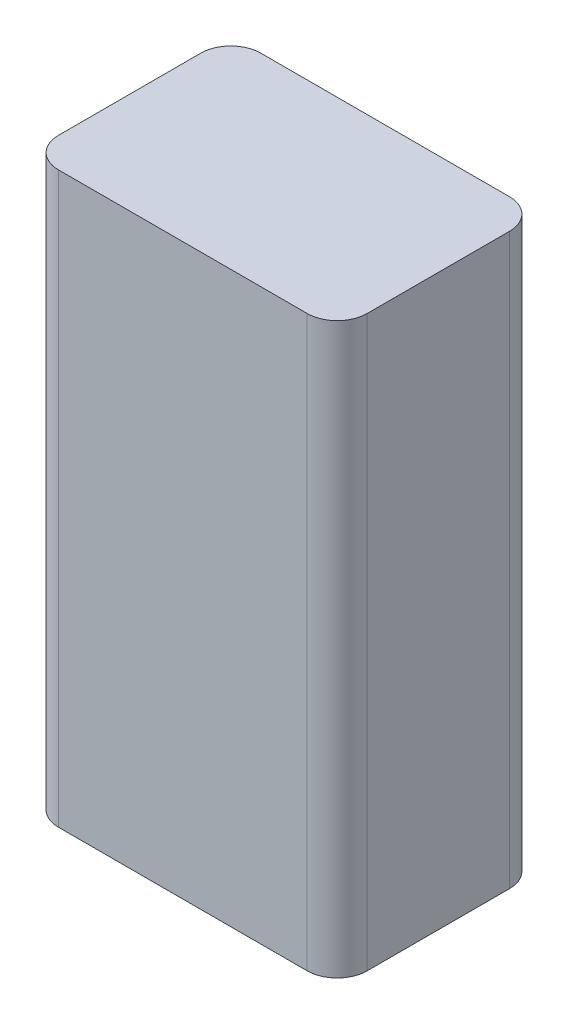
ISO-10303-21;
HEADER;
FILE_DESCRIPTION(('STEP AP214'),'2;1');
FILE_NAME('part.step','',(''),(''),'','','');
FILE_SCHEMA(('AUTOMOTIVE_DESIGN { 1 0 10303 214 1 1 1 1 }'));
ENDSEC;
DATA;
#1=APPLICATION_CONTEXT('core data for automotive mechanical design processes');
#2=APPLICATION_PROTOCOL_DEFINITION('international standard','automotive_design',2000,#1);
#3=PRODUCT_CONTEXT('',#1,'mechanical');
#4=PRODUCT('Part','Part','',(#3));
#5=PRODUCT_RELATED_PRODUCT_CATEGORY('part','',(#4));
#6=PRODUCT_DEFINITION_FORMATION('','',#4);
#7=PRODUCT_DEFINITION_CONTEXT('part definition',#1,'design');
#8=PRODUCT_DEFINITION('design','',#6,#7);
#9=PRODUCT_DEFINITION_SHAPE('','',#8);
#10=(LENGTH_UNIT() NAMED_UNIT(*) SI_UNIT(.MILLI.,.METRE.));
#11=(NAMED_UNIT(*) PLANE_ANGLE_UNIT() SI_UNIT($,.RADIAN.));
#12=(NAMED_UNIT(*) SI_UNIT($,.STERADIAN.) SOLID_ANGLE_UNIT());
#13=UNCERTAINTY_MEASURE_WITH_UNIT(LENGTH_MEASURE(1.E-05),#10,'distance_accuracy_value','');
#14=(GEOMETRIC_REPRESENTATION_CONTEXT(3) GLOBAL_UNCERTAINTY_ASSIGNED_CONTEXT((#13)) GLOBAL_UNIT_ASSIGNED_CONTEXT((#10,
#11,#12)) REPRESENTATION_CONTEXT('',''));
#15=CARTESIAN_POINT('',(0.,0.,0.));
#16=DIRECTION('',(0.,0.,1.));
#17=DIRECTION('',(1.,0.,0.));
#18=AXIS2_PLACEMENT_3D('',#15,#16,#17);
#19=CARTESIAN_POINT('',(13.081,-24.13,8.5725));
#20=DIRECTION('',(-1.,0.,0.));
#21=DIRECTION('',(0.,0.,1.));
#22=AXIS2_PLACEMENT_3D('',#19,#20,#21);
#23=PLANE('',#22);
#24=DIRECTION('',(0.,0.,-1.));
#25=VECTOR('',#24,1.);
#26=CARTESIAN_POINT('',(13.081,-24.13,8.5725));
#27=LINE('',#26,#25);
#28=CARTESIAN_POINT('',(13.081,-24.13,6.0325));
#29=VERTEX_POINT('',#28);
#30=CARTESIAN_POINT('',(13.081,-24.13,-6.0325));
#31=VERTEX_POINT('',#30);
#32=EDGE_CURVE('E127',#29,#31,#27,.T.);
#33=ORIENTED_EDGE('',*,*,#32,.T.);
#34=DIRECTION('',(0.,1.,0.));
#35=VECTOR('',#34,1.);
#36=CARTESIAN_POINT('',(13.081,24.13,-6.0325));
#37=LINE('',#36,#35);
#38=CARTESIAN_POINT('',(13.081,24.13,-6.0325));
#39=VERTEX_POINT('',#38);
#40=EDGE_CURVE('E153',#31,#39,#37,.T.);
#41=ORIENTED_EDGE('',*,*,#40,.T.);
#42=DIRECTION('',(0.,0.,-1.));
#43=VECTOR('',#42,1.);
#44=CARTESIAN_POINT('',(13.081,24.13,8.5725));
#45=LINE('',#44,#43);
#46=CARTESIAN_POINT('',(13.081,24.13,6.0325));
#47=VERTEX_POINT('',#46);
#48=EDGE_CURVE('E131',#47,#39,#45,.T.);
#49=ORIENTED_EDGE('',*,*,#48,.F.);
#50=DIRECTION('',(0.,1.,0.));
#51=VECTOR('',#50,1.);
#52=CARTESIAN_POINT('',(13.081,-24.13,6.0325));
#53=LINE('',#52,#51);
#54=EDGE_CURVE('E151',#47,#29,#53,.F.);
#55=ORIENTED_EDGE('',*,*,#54,.T.);
#56=EDGE_LOOP('',(#33,#41,#49,#55));
#57=FACE_BOUND('',#56,.T.);
#58=ADVANCED_FACE('F39',(#57),#23,.F.);
#59=CARTESIAN_POINT('',(-13.081,24.13,8.5725));
#60=DIRECTION('',(0.,-1.,0.));
#61=DIRECTION('',(0.,0.,-1.));
#62=AXIS2_PLACEMENT_3D('',#59,#60,#61);
#63=PLANE('',#62);
#64=DIRECTION('',(-1.,0.,0.));
#65=VECTOR('',#64,1.);
#66=CARTESIAN_POINT('',(-13.081,24.13,-8.5725));
#67=LINE('',#66,#65);
#68=CARTESIAN_POINT('',(10.541,24.13,-8.5725));
#69=VERTEX_POINT('',#68);
#70=CARTESIAN_POINT('',(-10.541,24.13,-8.5725));
#71=VERTEX_POINT('',#70);
#72=EDGE_CURVE('E163',#69,#71,#67,.T.);
#73=ORIENTED_EDGE('',*,*,#72,.T.);
#74=CARTESIAN_POINT('',(-10.541,24.13,-6.0325));
#75=DIRECTION('',(0.,-1.,0.));
#76=DIRECTION('',(0.,0.,-1.));
#77=AXIS2_PLACEMENT_3D('',#74,#75,#76);
#78=CIRCLE('',#77,2.54);
#79=CARTESIAN_POINT('',(-13.081,24.13,-6.0325));
#80=VERTEX_POINT('',#79);
#81=EDGE_CURVE('E149',#71,#80,#78,.F.);
#82=ORIENTED_EDGE('',*,*,#81,.T.);
#83=DIRECTION('',(0.,0.,-1.));
#84=VECTOR('',#83,1.);
#85=CARTESIAN_POINT('',(-13.081,24.13,8.5725));
#86=LINE('',#85,#84);
#87=CARTESIAN_POINT('',(-13.081,24.13,6.0325));
#88=VERTEX_POINT('',#87);
#89=EDGE_CURVE('E126',#88,#80,#86,.T.);
#90=ORIENTED_EDGE('',*,*,#89,.F.);
#91=CARTESIAN_POINT('',(-10.541,24.13,6.0325));
#92=DIRECTION('',(0.,-1.,0.));
#93=DIRECTION('',(0.,0.,-1.));
#94=AXIS2_PLACEMENT_3D('',#91,#92,#93);
#95=CIRCLE('',#94,2.54);
#96=CARTESIAN_POINT('',(-10.541,24.13,8.5725));
#97=VERTEX_POINT('',#96);
#98=EDGE_CURVE('E130',#88,#97,#95,.F.);
#99=ORIENTED_EDGE('',*,*,#98,.T.);
#100=DIRECTION('',(-1.,0.,0.));
#101=VECTOR('',#100,1.);
#102=CARTESIAN_POINT('',(-13.081,24.13,8.5725));
#103=LINE('',#102,#101);
#104=CARTESIAN_POINT('',(10.541,24.13,8.5725));
#105=VERTEX_POINT('',#104);
#106=EDGE_CURVE('E158',#105,#97,#103,.T.);
#107=ORIENTED_EDGE('',*,*,#106,.F.);
#108=CARTESIAN_POINT('',(10.541,24.13,6.0325));
#109=DIRECTION('',(0.,-1.,0.));
#110=DIRECTION('',(0.,0.,-1.));
#111=AXIS2_PLACEMENT_3D('',#108,#109,#110);
#112=CIRCLE('',#111,2.54);
#113=EDGE_CURVE('E62',#105,#47,#112,.F.);
#114=ORIENTED_EDGE('',*,*,#113,.T.);
#115=ORIENTED_EDGE('',*,*,#48,.T.);
#116=CARTESIAN_POINT('',(10.541,24.13,-6.0325));
#117=DIRECTION('',(0.,-1.,0.));
#118=DIRECTION('',(0.,0.,-1.));
#119=AXIS2_PLACEMENT_3D('',#116,#117,#118);
#120=CIRCLE('',#119,2.54);
#121=EDGE_CURVE('E54',#39,#69,#120,.F.);
#122=ORIENTED_EDGE('',*,*,#121,.T.);
#123=EDGE_LOOP('',(#73,#82,#90,#99,#107,#114,#115,#122));
#124=FACE_BOUND('',#123,.T.);
#125=ADVANCED_FACE('F192',(#124),#63,.F.);
#126=CARTESIAN_POINT('',(-13.081,-24.13,8.5725));
#127=DIRECTION('',(1.,0.,0.));
#128=DIRECTION('',(0.,0.,-1.));
#129=AXIS2_PLACEMENT_3D('',#126,#127,#128);
#130=PLANE('',#129);
#131=ORIENTED_EDGE('',*,*,#89,.T.);
#132=DIRECTION('',(0.,-1.,0.));
#133=VECTOR('',#132,1.);
#134=CARTESIAN_POINT('',(-13.081,-24.13,-6.0325));
#135=LINE('',#134,#133);
#136=CARTESIAN_POINT('',(-13.081,-24.13,-6.0325));
#137=VERTEX_POINT('',#136);
#138=EDGE_CURVE('E117',#80,#137,#135,.T.);
#139=ORIENTED_EDGE('',*,*,#138,.T.);
#140=DIRECTION('',(0.,0.,-1.));
#141=VECTOR('',#140,1.);
#142=CARTESIAN_POINT('',(-13.081,-24.13,8.5725));
#143=LINE('',#142,#141);
#144=CARTESIAN_POINT('',(-13.081,-24.13,6.0325));
#145=VERTEX_POINT('',#144);
#146=EDGE_CURVE('E109',#145,#137,#143,.T.);
#147=ORIENTED_EDGE('',*,*,#146,.F.);
#148=DIRECTION('',(0.,-1.,0.));
#149=VECTOR('',#148,1.);
#150=CARTESIAN_POINT('',(-13.081,-24.13,6.0325));
#151=LINE('',#150,#149);
#152=EDGE_CURVE('E123',#145,#88,#151,.F.);
#153=ORIENTED_EDGE('',*,*,#152,.T.);
#154=EDGE_LOOP('',(#131,#139,#147,#153));
#155=FACE_BOUND('',#154,.T.);
#156=ADVANCED_FACE('F122',(#155),#130,.F.);
#157=CARTESIAN_POINT('',(-13.081,-24.13,8.5725));
#158=DIRECTION('',(0.,1.,0.));
#159=DIRECTION('',(0.,0.,1.));
#160=AXIS2_PLACEMENT_3D('',#157,#158,#159);
#161=PLANE('',#160);
#162=ORIENTED_EDGE('',*,*,#146,.T.);
#163=CARTESIAN_POINT('',(-10.541,-24.13,-6.0325));
#164=DIRECTION('',(0.,1.,0.));
#165=DIRECTION('',(0.,0.,1.));
#166=AXIS2_PLACEMENT_3D('',#163,#164,#165);
#167=CIRCLE('',#166,2.54);
#168=CARTESIAN_POINT('',(-10.541,-24.13,-8.5725));
#169=VERTEX_POINT('',#168);
#170=EDGE_CURVE('E140',#137,#169,#167,.F.);
#171=ORIENTED_EDGE('',*,*,#170,.T.);
#172=DIRECTION('',(1.,0.,0.));
#173=VECTOR('',#172,1.);
#174=CARTESIAN_POINT('',(-13.081,-24.13,-8.5725));
#175=LINE('',#174,#173);
#176=CARTESIAN_POINT('',(10.541,-24.13,-8.5725));
#177=VERTEX_POINT('',#176);
#178=EDGE_CURVE('E159',#169,#177,#175,.T.);
#179=ORIENTED_EDGE('',*,*,#178,.T.);
#180=CARTESIAN_POINT('',(10.541,-24.13,-6.0325));
#181=DIRECTION('',(0.,1.,0.));
#182=DIRECTION('',(0.,0.,1.));
#183=AXIS2_PLACEMENT_3D('',#180,#181,#182);
#184=CIRCLE('',#183,2.54);
#185=EDGE_CURVE('E138',#177,#31,#184,.F.);
#186=ORIENTED_EDGE('',*,*,#185,.T.);
#187=ORIENTED_EDGE('',*,*,#32,.F.);
#188=CARTESIAN_POINT('',(10.541,-24.13,6.0325));
#189=DIRECTION('',(0.,1.,0.));
#190=DIRECTION('',(0.,0.,1.));
#191=AXIS2_PLACEMENT_3D('',#188,#189,#190);
#192=CIRCLE('',#191,2.54);
#193=CARTESIAN_POINT('',(10.541,-24.13,8.5725));
#194=VERTEX_POINT('',#193);
#195=EDGE_CURVE('E116',#29,#194,#192,.F.);
#196=ORIENTED_EDGE('',*,*,#195,.T.);
#197=DIRECTION('',(1.,0.,0.));
#198=VECTOR('',#197,1.);
#199=CARTESIAN_POINT('',(-13.081,-24.13,8.5725));
#200=LINE('',#199,#198);
#201=CARTESIAN_POINT('',(-10.541,-24.13,8.5725));
#202=VERTEX_POINT('',#201);
#203=EDGE_CURVE('E111',#202,#194,#200,.T.);
#204=ORIENTED_EDGE('',*,*,#203,.F.);
#205=CARTESIAN_POINT('',(-10.541,-24.13,6.0325));
#206=DIRECTION('',(0.,1.,0.));
#207=DIRECTION('',(0.,0.,1.));
#208=AXIS2_PLACEMENT_3D('',#205,#206,#207);
#209=CIRCLE('',#208,2.54);
#210=EDGE_CURVE('E106',#202,#145,#209,.F.);
#211=ORIENTED_EDGE('',*,*,#210,.T.);
#212=EDGE_LOOP('',(#162,#171,#179,#186,#187,#196,#204,#211));
#213=FACE_BOUND('',#212,.T.);
#214=ADVANCED_FACE('F108',(#213),#161,.F.);
#215=CARTESIAN_POINT('',(0.,0.,8.5725));
#216=DIRECTION('',(0.,0.,-1.));
#217=DIRECTION('',(-1.,0.,0.));
#218=AXIS2_PLACEMENT_3D('',#215,#216,#217);
#219=PLANE('',#218);
#220=ORIENTED_EDGE('',*,*,#203,.T.);
#221=DIRECTION('',(0.,1.,0.));
#222=VECTOR('',#221,1.);
#223=CARTESIAN_POINT('',(10.541,0.,8.5725));
#224=LINE('',#223,#222);
#225=EDGE_CURVE('E11',#194,#105,#224,.T.);
#226=ORIENTED_EDGE('',*,*,#225,.T.);
#227=ORIENTED_EDGE('',*,*,#106,.T.);
#228=DIRECTION('',(0.,-1.,0.));
#229=VECTOR('',#228,1.);
#230=CARTESIAN_POINT('',(-10.541,0.,8.5725));
#231=LINE('',#230,#229);
#232=EDGE_CURVE('E47',#97,#202,#231,.T.);
#233=ORIENTED_EDGE('',*,*,#232,.T.);
#234=EDGE_LOOP('',(#220,#226,#227,#233));
#235=FACE_BOUND('',#234,.T.);
#236=ADVANCED_FACE('F156',(#235),#219,.F.);
#237=CARTESIAN_POINT('',(0.,0.,-8.5725));
#238=DIRECTION('',(0.,0.,-1.));
#239=DIRECTION('',(-1.,0.,0.));
#240=AXIS2_PLACEMENT_3D('',#237,#238,#239);
#241=PLANE('',#240);
#242=ORIENTED_EDGE('',*,*,#178,.F.);
#243=DIRECTION('',(0.,-1.,0.));
#244=VECTOR('',#243,1.);
#245=CARTESIAN_POINT('',(-10.541,24.13,-8.5725));
#246=LINE('',#245,#244);
#247=EDGE_CURVE('E144',#169,#71,#246,.F.);
#248=ORIENTED_EDGE('',*,*,#247,.T.);
#249=ORIENTED_EDGE('',*,*,#72,.F.);
#250=DIRECTION('',(0.,1.,0.));
#251=VECTOR('',#250,1.);
#252=CARTESIAN_POINT('',(10.541,-24.13,-8.5725));
#253=LINE('',#252,#251);
#254=EDGE_CURVE('E142',#69,#177,#253,.F.);
#255=ORIENTED_EDGE('',*,*,#254,.T.);
#256=EDGE_LOOP('',(#242,#248,#249,#255));
#257=FACE_BOUND('',#256,.T.);
#258=ADVANCED_FACE('F176',(#257),#241,.T.);
#259=CARTESIAN_POINT('',(-10.541,-24.13,-6.0325));
#260=DIRECTION('',(0.,1.,0.));
#261=DIRECTION('',(0.,0.,1.));
#262=AXIS2_PLACEMENT_3D('',#259,#260,#261);
#263=CYLINDRICAL_SURFACE('',#262,2.54);
#264=ORIENTED_EDGE('',*,*,#81,.F.);
#265=ORIENTED_EDGE('',*,*,#247,.F.);
#266=ORIENTED_EDGE('',*,*,#170,.F.);
#267=ORIENTED_EDGE('',*,*,#138,.F.);
#268=EDGE_LOOP('',(#264,#265,#266,#267));
#269=FACE_BOUND('',#268,.T.);
#270=ADVANCED_FACE('F171',(#269),#263,.T.);
#271=CARTESIAN_POINT('',(10.541,-24.13,-6.0325));
#272=DIRECTION('',(0.,-1.,0.));
#273=DIRECTION('',(0.,0.,-1.));
#274=AXIS2_PLACEMENT_3D('',#271,#272,#273);
#275=CYLINDRICAL_SURFACE('',#274,2.54);
#276=ORIENTED_EDGE('',*,*,#185,.F.);
#277=ORIENTED_EDGE('',*,*,#254,.F.);
#278=ORIENTED_EDGE('',*,*,#121,.F.);
#279=ORIENTED_EDGE('',*,*,#40,.F.);
#280=EDGE_LOOP('',(#276,#277,#278,#279));
#281=FACE_BOUND('',#280,.T.);
#282=ADVANCED_FACE('F178',(#281),#275,.T.);
#283=CARTESIAN_POINT('',(10.541,0.,6.0325));
#284=DIRECTION('',(0.,1.,0.));
#285=DIRECTION('',(0.,0.,1.));
#286=AXIS2_PLACEMENT_3D('',#283,#284,#285);
#287=CYLINDRICAL_SURFACE('',#286,2.54);
#288=ORIENTED_EDGE('',*,*,#195,.F.);
#289=ORIENTED_EDGE('',*,*,#54,.F.);
#290=ORIENTED_EDGE('',*,*,#113,.F.);
#291=ORIENTED_EDGE('',*,*,#225,.F.);
#292=EDGE_LOOP('',(#288,#289,#290,#291));
#293=FACE_BOUND('',#292,.T.);
#294=ADVANCED_FACE('F184',(#293),#287,.T.);
#295=CARTESIAN_POINT('',(-10.541,0.,6.0325));
#296=DIRECTION('',(0.,-1.,0.));
#297=DIRECTION('',(0.,0.,-1.));
#298=AXIS2_PLACEMENT_3D('',#295,#296,#297);
#299=CYLINDRICAL_SURFACE('',#298,2.54);
#300=ORIENTED_EDGE('',*,*,#98,.F.);
#301=ORIENTED_EDGE('',*,*,#152,.F.);
#302=ORIENTED_EDGE('',*,*,#210,.F.);
#303=ORIENTED_EDGE('',*,*,#232,.F.);
#304=EDGE_LOOP('',(#300,#301,#302,#303));
#305=FACE_BOUND('',#304,.T.);
#306=ADVANCED_FACE('F41',(#305),#299,.T.);
#307=CLOSED_SHELL('',(#58,#125,#156,#214,#236,#258,#270,#282,#294,#306));
#308=MANIFOLD_SOLID_BREP('B2',#307);
#309=ADVANCED_BREP_SHAPE_REPRESENTATION('',(#18,#308),#14);
#310=SHAPE_DEFINITION_REPRESENTATION(#9,#309);
ENDSEC;
END-ISO-10303-21;
